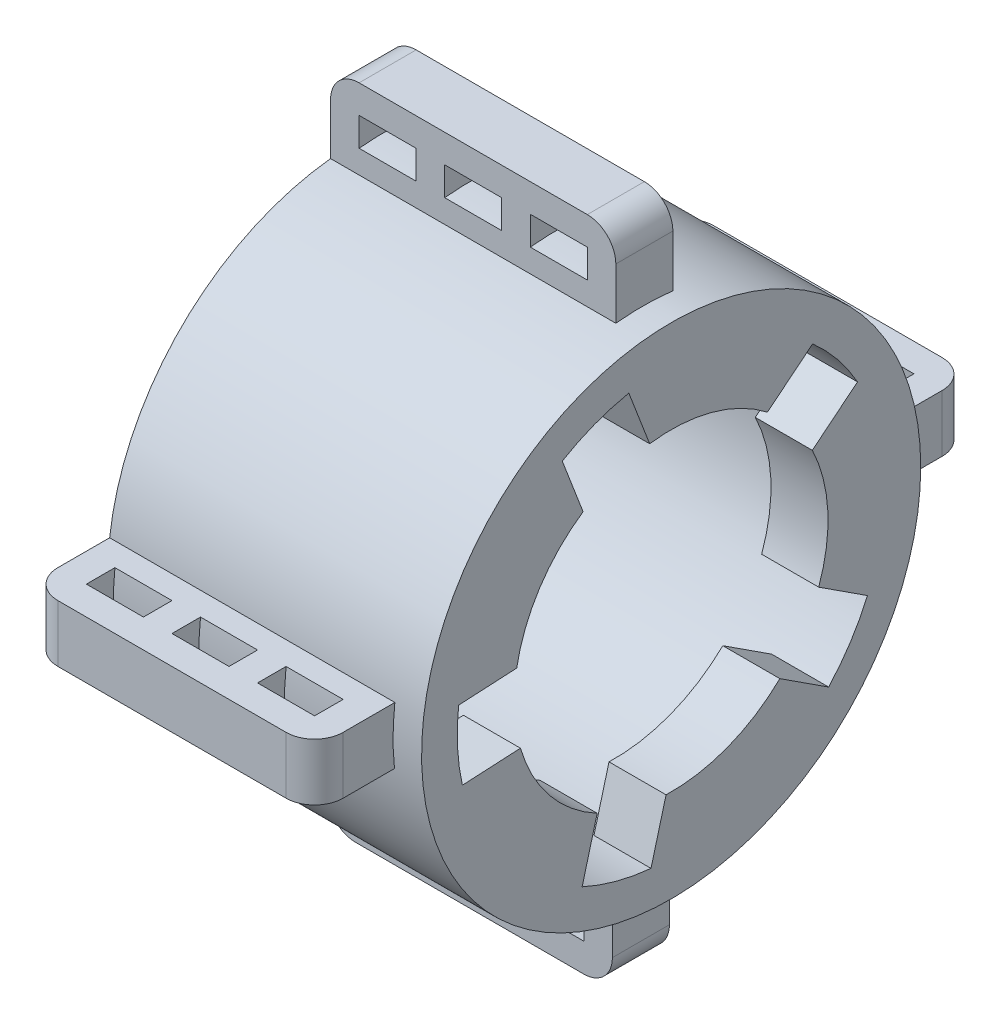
from build123d import *

# Parameters (mm, degrees)
SKETCH_2_R           = 15
EXTRUDE_1_DEPTH      = 20
SKETCH_3_W           = 4
SKETCH_3_H           = 2
FILLET_1_R           = 2
EXTRUDE_2_DEPTH      = 2
EXTRUDE_2_DEPTH_BACK = 2
SKETCH_4_R           = 17.5
CUT_EXTRUDE_1_REACH  = 41.268
SKETCH_5_R           = 4


with BuildPart() as part:
    # Sketch 2 → Extrude 1 (new body)
    with BuildSketch(Plane(origin=(0, 0, 0), x_dir=(0, 0, -1), z_dir=(1, 0, 0))):
        with BuildLine():
            Line((-1.878787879, 23), (2.121212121, 23))
            Line((2.121212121, 23), (2.121212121, 17.370965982))
            ThreePointArc((2.121212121, 17.370965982), (12.46034313, 12.287792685), (17.398855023, 1.878787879))
            Line((17.398855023, 1.878787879), (23, 1.878787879))
            Line((23, 1.878787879), (23, -2.121212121))
            Line((23, -2.121212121), (17.370965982, -2.121212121))
            ThreePointArc((17.370965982, -2.121212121), (12.287792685, -12.46034313), (1.878787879, -17.398855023))
            Line((1.878787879, -17.398855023), (1.878787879, -23))
            Line((1.878787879, -23), (-2.121212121, -23))
            Line((-2.121212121, -23), (-2.121212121, -17.370965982))
            ThreePointArc((-2.121212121, -17.370965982), (-12.46034313, -12.287792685), (-17.398855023, -1.878787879))
            Line((-17.398855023, -1.878787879), (-23, -1.878787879))
            Line((-23, -1.878787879), (-23, 2.121212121))
            Line((-23, 2.121212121), (-17.370965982, 2.121212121))
            ThreePointArc((-17.370965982, 2.121212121), (-12.287792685, 12.46034313), (-1.878787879, 17.398855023))
            Line((-1.878787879, 17.398855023), (-1.878787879, 23))
        make_face()
        Circle(SKETCH_2_R, mode=Mode.SUBTRACT)
    extrude(amount=EXTRUDE_1_DEPTH)

    # Sweep 1: sweep along a curve in space
    with BuildLine() as sweep_1_path:
        ThreePointArc((20, 0, -15), (20, 10.606601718, -10.606601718), (20, 15, 0))
        ThreePointArc((20, 15, 0), (20, 10.606601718, 10.606601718), (20, 0, 15))
        ThreePointArc((20, 0, 15), (20, -10.606601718, 10.606601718), (20, -15, 0))
        ThreePointArc((20, -15, 0), (20, -10.606601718, -10.606601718), (20, 0, -15))
    # Sketch 3 → Sweep 1 (sweep, cut)
    with BuildSketch(Plane.XY.offset(2.121212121)):
        with Locations((16, -20)):
            Rectangle(SKETCH_3_W, SKETCH_3_H)
        with Locations((10, -20)):
            Rectangle(SKETCH_3_W, SKETCH_3_H)
        with Locations((4, -20)):
            Rectangle(SKETCH_3_W, SKETCH_3_H)
    sweep(path=sweep_1_path.line, mode=Mode.SUBTRACT)

    # Fillet 1
    fillet_1_edges = [part.edges().sort_by_distance(p)[0] for p in [
        (20, 0.121212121, 23),
        (0, 23, -0.121212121),
        (0, -0.121212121, -23),
        (0, -23, 0.121212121),
        (0, 0.121212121, 23),
        (20, -23, 0.121212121),
        (20, -0.121212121, -23),
        (20, 23, -0.121212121),
    ]]
    fillet(fillet_1_edges, radius=FILLET_1_R)

    # Sketch 4 → Extrude 2 (add, two sides: drawn at the far end of the back side and taken through both)
    with BuildSketch(Plane(origin=(20, 0, 0), x_dir=(0, 0, -1), z_dir=(1, 0, 0)).offset(-EXTRUDE_2_DEPTH_BACK)):
        with Locations(Location((0, 0, 0), (0, 0, 186.16311346))):
            Circle(SKETCH_4_R)
    extrude(amount=EXTRUDE_2_DEPTH + EXTRUDE_2_DEPTH_BACK)

    # Sketch 5 → Cut-Extrude 1 (cut, up to next)
    with BuildSketch(Plane(origin=(22, 0, 0), x_dir=(0, 0, -1), z_dir=(1, 0, 0)), mode=Mode.PRIVATE) as cut_extrude_1_sk1:
        Circle(SKETCH_5_R)
    cut_extrude_1_tool1 = extrude(cut_extrude_1_sk1.sketch, amount=-CUT_EXTRUDE_1_REACH, mode=Mode.PRIVATE) & part.part
    # Sketch 5 → Cut-Extrude 1 (cut, up to next)
    with BuildSketch(Plane(origin=(22, 0, 0), x_dir=(0, 0, -1), z_dir=(1, 0, 0)), mode=Mode.PRIVATE) as cut_extrude_1_sk2:
        with BuildLine():
            ThreePointArc((-14.900889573, 1.721479), (-14.979388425, -0.786080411), (-14.638862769, -3.271650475))
            Line((-14.638862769, -3.271650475), (-10.566409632, -3.057938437))
            ThreePointArc((-10.566409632, -3.057938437), (-10.984884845, -0.576458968), (-10.828436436, 1.935191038))
            Line((-10.828436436, 1.935191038), (-14.900889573, 1.721479))
        make_face()
    cut_extrude_1_tool2 = extrude(cut_extrude_1_sk2.sketch, amount=-CUT_EXTRUDE_1_REACH, mode=Mode.PRIVATE) & part.part
    # Sketch 5 → Cut-Extrude 1 (cut, up to next)
    with BuildSketch(Plane(origin=(22, 0, 0), x_dir=(0, 0, -1), z_dir=(1, 0, 0)), mode=Mode.PRIVATE) as cut_extrude_1_sk3:
        with BuildLine():
            Line((-10.566409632, -3.057938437), (-3.305213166, -2.676889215))
            Line((-3.305213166, -2.676889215), (-3.222812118, -2.369278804))
            ThreePointArc((-3.222812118, -2.369278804), (-3.99450358, -0.209621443), (-3.453094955, 2.018944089))
            Line((-3.453094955, 2.018944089), (-3.56723997, 2.31624026))
            Line((-3.56723997, 2.31624026), (-10.828436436, 1.935191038))
            ThreePointArc((-10.828436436, 1.935191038), (-10.984884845, -0.576458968), (-10.566409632, -3.057938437))
        make_face()
    cut_extrude_1_tool3 = extrude(cut_extrude_1_sk3.sketch, amount=-CUT_EXTRUDE_1_REACH, mode=Mode.PRIVATE) & part.part
    # Sketch 5 → Cut-Extrude 1 (cut, up to next)
    with BuildSketch(Plane(origin=(22, 0, 0), x_dir=(0, 0, -1), z_dir=(1, 0, 0)), mode=Mode.PRIVATE) as cut_extrude_1_sk4:
        with BuildLine():
            Line((-0.356927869, -10.994207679), (1.524505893, -3.970648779))
            Line((1.524505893, -3.970648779), (1.257414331, -3.797223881))
            ThreePointArc((1.257414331, -3.797223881), (-1.035007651, -3.863775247), (-2.987194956, -2.660200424))
            Line((-2.987194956, -2.660200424), (-3.305213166, -2.676889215))
            Line((-3.305213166, -2.676889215), (-5.186646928, -9.700448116))
            ThreePointArc((-5.186646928, -9.700448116), (-2.84627104, -10.62538193), (-0.356927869, -10.994207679))
        make_face()
    cut_extrude_1_tool4 = extrude(cut_extrude_1_sk4.sketch, amount=-CUT_EXTRUDE_1_REACH, mode=Mode.PRIVATE) & part.part
    # Sketch 5 → Cut-Extrude 1 (cut, up to next)
    with BuildSketch(Plane(origin=(22, 0, 0), x_dir=(0, 0, -1), z_dir=(1, 0, 0)), mode=Mode.PRIVATE) as cut_extrude_1_sk5:
        with BuildLine():
            ThreePointArc((-6.241851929, -13.63962186), (-3.881278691, -14.489157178), (-1.41213287, -14.933381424))
            Line((-1.41213287, -14.933381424), (-0.356927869, -10.994207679))
            ThreePointArc((-0.356927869, -10.994207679), (-2.84627104, -10.62538193), (-5.186646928, -9.700448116))
            Line((-5.186646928, -9.700448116), (-6.241851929, -13.63962186))
        make_face()
    cut_extrude_1_tool5 = extrude(cut_extrude_1_sk5.sketch, amount=-CUT_EXTRUDE_1_REACH, mode=Mode.PRIVATE) & part.part
    # Sketch 5 → Cut-Extrude 1 (cut, up to next)
    with BuildSketch(Plane(origin=(22, 0, 0), x_dir=(0, 0, -1), z_dir=(1, 0, 0)), mode=Mode.PRIVATE) as cut_extrude_1_sk6:
        with BuildLine():
            ThreePointArc((7.622912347, -7.93039768), (8.480013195, -7.006381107), (9.225792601, -5.990388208))
            Line((9.225792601, -5.990388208), (3.354833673, -2.178322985))
            ThreePointArc((3.354833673, -2.178322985), (2.589558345, -3.048637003), (1.606906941, -3.663038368))
            Line((1.606906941, -3.663038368), (1.524505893, -3.970648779))
            Line((1.524505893, -3.970648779), (7.622912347, -7.93039768))
        make_face()
    cut_extrude_1_tool6 = extrude(cut_extrude_1_sk6.sketch, amount=-CUT_EXTRUDE_1_REACH, mode=Mode.PRIVATE) & part.part
    # Sketch 5 → Cut-Extrude 1 (cut, up to next)
    with BuildSketch(Plane(origin=(22, 0, 0), x_dir=(0, 0, -1), z_dir=(1, 0, 0)), mode=Mode.PRIVATE) as cut_extrude_1_sk7:
        with BuildLine():
            Line((3.354833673, -2.178322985), (9.225792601, -5.990388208))
            ThreePointArc((9.225792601, -5.990388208), (9.850460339, -4.89575644), (10.345816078, -3.736855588))
            Line((10.345816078, -3.736855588), (4.247409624, 0.222893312))
            Line((4.247409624, 0.222893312), (3.999936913, 0.022465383))
            ThreePointArc((3.999936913, 0.022465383), (3.999984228, 0.011232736), (4, 0))
            ThreePointArc((4, 0), (3.835318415, -1.135928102), (3.354833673, -2.178322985))
        make_face()
    cut_extrude_1_tool7 = extrude(cut_extrude_1_sk7.sketch, amount=-CUT_EXTRUDE_1_REACH, mode=Mode.PRIVATE) & part.part
    # Sketch 5 → Cut-Extrude 1 (cut, up to next)
    with BuildSketch(Plane(origin=(22, 0, 0), x_dir=(0, 0, -1), z_dir=(1, 0, 0)), mode=Mode.PRIVATE) as cut_extrude_1_sk8:
        with BuildLine():
            Line((9.225792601, -5.990388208), (12.580626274, -8.168711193))
            ThreePointArc((12.580626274, -8.168711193), (13.219677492, -7.088027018), (13.766116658, -5.957686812))
            Line((13.766116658, -5.957686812), (10.345816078, -3.736855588))
            ThreePointArc((10.345816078, -3.736855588), (9.850460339, -4.89575644), (9.225792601, -5.990388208))
        make_face()
    cut_extrude_1_tool8 = extrude(cut_extrude_1_sk8.sketch, amount=-CUT_EXTRUDE_1_REACH, mode=Mode.PRIVATE) & part.part
    # Sketch 5 → Cut-Extrude 1 (cut, up to next)
    with BuildSketch(Plane(origin=(22, 0, 0), x_dir=(0, 0, -1), z_dir=(1, 0, 0)), mode=Mode.PRIVATE) as cut_extrude_1_sk9:
        with BuildLine():
            ThreePointArc((11.043212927, -10.151228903), (11.853439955, -9.192168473), (12.580626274, -8.168711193))
            Line((12.580626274, -8.168711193), (9.225792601, -5.990388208))
            ThreePointArc((9.225792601, -5.990388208), (8.480013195, -7.006381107), (7.622912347, -7.93039768))
            Line((7.622912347, -7.93039768), (11.043212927, -10.151228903))
        make_face()
    cut_extrude_1_tool9 = extrude(cut_extrude_1_sk9.sketch, amount=-CUT_EXTRUDE_1_REACH, mode=Mode.PRIVATE) & part.part
    # Sketch 5 → Cut-Extrude 1 (cut, up to next)
    with BuildSketch(Plane(origin=(22, 0, 0), x_dir=(0, 0, -1), z_dir=(1, 0, 0)), mode=Mode.PRIVATE) as cut_extrude_1_sk10:
        with BuildLine():
            Line((9.897865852, 4.799192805), (13.066932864, 7.365817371))
            ThreePointArc((13.066932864, 7.365817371), (11.656533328, 9.440616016), (9.920060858, 11.25132848))
            Line((9.920060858, 11.25132848), (6.750993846, 8.684703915))
            ThreePointArc((6.750993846, 8.684703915), (8.548124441, 6.923118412), (9.897865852, 4.799192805))
        make_face()
    cut_extrude_1_tool10 = extrude(cut_extrude_1_sk10.sketch, amount=-CUT_EXTRUDE_1_REACH, mode=Mode.PRIVATE) & part.part
    # Sketch 5 → Cut-Extrude 1 (cut, up to next)
    with BuildSketch(Plane(origin=(22, 0, 0), x_dir=(0, 0, -1), z_dir=(1, 0, 0)), mode=Mode.PRIVATE) as cut_extrude_1_sk11:
        with BuildLine():
            Line((3.980318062, 0.396318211), (4.247409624, 0.222893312))
            Line((4.247409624, 0.222893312), (9.897865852, 4.799192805))
            ThreePointArc((9.897865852, 4.799192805), (8.548124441, 6.923118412), (6.750993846, 8.684703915))
            Line((6.750993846, 8.684703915), (1.100537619, 4.108404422))
            Line((1.100537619, 4.108404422), (1.214682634, 3.811108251))
            ThreePointArc((1.214682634, 3.811108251), (3.108408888, 2.517497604), (3.980318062, 0.396318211))
        make_face()
    cut_extrude_1_tool11 = extrude(cut_extrude_1_sk11.sketch, amount=-CUT_EXTRUDE_1_REACH, mode=Mode.PRIVATE) & part.part
    # Sketch 5 → Cut-Extrude 1 (cut, up to next)
    with BuildSketch(Plane(origin=(22, 0, 0), x_dir=(0, 0, -1), z_dir=(1, 0, 0)), mode=Mode.PRIVATE) as cut_extrude_1_sk12:
        with BuildLine():
            Line((-1.505694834, 10.896461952), (-2.967404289, 14.703554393))
            ThreePointArc((-2.967404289, 14.703554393), (-5.376492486, 14.003332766), (-7.635181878, 12.911390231))
            Line((-7.635181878, 12.911390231), (-6.173472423, 9.10429779))
            ThreePointArc((-6.173472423, 9.10429779), (-3.942761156, 10.269110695), (-1.505694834, 10.896461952))
        make_face()
    cut_extrude_1_tool12 = extrude(cut_extrude_1_sk12.sketch, amount=-CUT_EXTRUDE_1_REACH, mode=Mode.PRIVATE) & part.part
    # Sketch 5 → Cut-Extrude 1 (cut, up to next)
    with BuildSketch(Plane(origin=(22, 0, 0), x_dir=(0, 0, -1), z_dir=(1, 0, 0)), mode=Mode.PRIVATE) as cut_extrude_1_sk13:
        with BuildLine():
            Line((0.853064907, 3.907976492), (1.100537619, 4.108404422))
            Line((1.100537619, 4.108404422), (-1.505694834, 10.896461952))
            ThreePointArc((-1.505694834, 10.896461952), (-3.942761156, 10.269110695), (-6.173472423, 9.10429779))
            Line((-6.173472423, 9.10429779), (-3.56723997, 2.31624026))
            Line((-3.56723997, 2.31624026), (-3.24922176, 2.332929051))
            ThreePointArc((-3.24922176, 2.332929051), (-1.43373133, 3.734222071), (0.853064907, 3.907976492))
        make_face()
    cut_extrude_1_tool13 = extrude(cut_extrude_1_sk13.sketch, amount=-CUT_EXTRUDE_1_REACH, mode=Mode.PRIVATE) & part.part
    # Sketch 5 → Cut-Extrude 1 (cut, up to next)
    with BuildSketch(Plane(origin=(22, 0, 0), x_dir=(0, 0, -1), z_dir=(1, 0, 0)), mode=Mode.PRIVATE) as cut_extrude_1_sk14:
        with BuildLine():
            Line((1.100537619, 4.108404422), (6.750993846, 8.684703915))
            ThreePointArc((6.750993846, 8.684703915), (2.84627104, 10.62538193), (-1.505694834, 10.896461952))
            Line((-1.505694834, 10.896461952), (1.100537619, 4.108404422))
        make_face()
    cut_extrude_1_tool14 = extrude(cut_extrude_1_sk14.sketch, amount=-CUT_EXTRUDE_1_REACH, mode=Mode.PRIVATE) & part.part
    # Sketch 5 → Cut-Extrude 1 (cut, up to next)
    with BuildSketch(Plane(origin=(22, 0, 0), x_dir=(0, 0, -1), z_dir=(1, 0, 0)), mode=Mode.PRIVATE) as cut_extrude_1_sk15:
        with BuildLine():
            Line((4.247409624, 0.222893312), (10.345816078, -3.736855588))
            ThreePointArc((10.345816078, -3.736855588), (10.835219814, -1.896842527), (11, 0))
            ThreePointArc((11, 0), (10.720926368, 2.462059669), (9.897865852, 4.799192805))
            Line((9.897865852, 4.799192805), (4.247409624, 0.222893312))
        make_face()
    cut_extrude_1_tool15 = extrude(cut_extrude_1_sk15.sketch, amount=-CUT_EXTRUDE_1_REACH, mode=Mode.PRIVATE) & part.part
    # Sketch 5 → Cut-Extrude 1 (cut, up to next)
    with BuildSketch(Plane(origin=(22, 0, 0), x_dir=(0, 0, -1), z_dir=(1, 0, 0)), mode=Mode.PRIVATE) as cut_extrude_1_sk16:
        with BuildLine():
            ThreePointArc((-0.356927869, -10.994207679), (3.942761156, -10.269110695), (7.622912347, -7.93039768))
            Line((7.622912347, -7.93039768), (1.524505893, -3.970648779))
            Line((1.524505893, -3.970648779), (-0.356927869, -10.994207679))
        make_face()
    cut_extrude_1_tool16 = extrude(cut_extrude_1_sk16.sketch, amount=-CUT_EXTRUDE_1_REACH, mode=Mode.PRIVATE) & part.part
    # Sketch 5 → Cut-Extrude 1 (cut, up to next)
    with BuildSketch(Plane(origin=(22, 0, 0), x_dir=(0, 0, -1), z_dir=(1, 0, 0)), mode=Mode.PRIVATE) as cut_extrude_1_sk17:
        with BuildLine():
            ThreePointArc((-10.566409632, -3.057938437), (-8.548124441, -6.923118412), (-5.186646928, -9.700448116))
            Line((-5.186646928, -9.700448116), (-3.305213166, -2.676889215))
            Line((-3.305213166, -2.676889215), (-10.566409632, -3.057938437))
        make_face()
    cut_extrude_1_tool17 = extrude(cut_extrude_1_sk17.sketch, amount=-CUT_EXTRUDE_1_REACH, mode=Mode.PRIVATE) & part.part
    # Sketch 5 → Cut-Extrude 1 (cut, up to next)
    with BuildSketch(Plane(origin=(22, 0, 0), x_dir=(0, 0, -1), z_dir=(1, 0, 0)), mode=Mode.PRIVATE) as cut_extrude_1_sk18:
        with BuildLine():
            ThreePointArc((-6.173472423, 9.10429779), (-9.225792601, 5.990388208), (-10.828436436, 1.935191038))
            Line((-10.828436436, 1.935191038), (-3.56723997, 2.31624026))
            Line((-3.56723997, 2.31624026), (-6.173472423, 9.10429779))
        make_face()
    cut_extrude_1_tool18 = extrude(cut_extrude_1_sk18.sketch, amount=-CUT_EXTRUDE_1_REACH, mode=Mode.PRIVATE) & part.part
    # Sketch 5 → Cut-Extrude 1 (cut, up to next)
    with BuildSketch(Plane(origin=(22, 0, 0), x_dir=(0, 0, -1), z_dir=(1, 0, 0)), mode=Mode.PRIVATE) as cut_extrude_1_sk19:
        with BuildLine():
            Line((3.999936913, 0.022465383), (4.247409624, 0.222893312))
            Line((4.247409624, 0.222893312), (3.980318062, 0.396318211))
            ThreePointArc((3.980318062, 0.396318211), (3.99450358, 0.209621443), (3.999936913, 0.022465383))
        make_face()
    cut_extrude_1_tool19 = extrude(cut_extrude_1_sk19.sketch, amount=-CUT_EXTRUDE_1_REACH, mode=Mode.PRIVATE) & part.part
    # Sketch 5 → Cut-Extrude 1 (cut, up to next)
    with BuildSketch(Plane(origin=(22, 0, 0), x_dir=(0, 0, -1), z_dir=(1, 0, 0)), mode=Mode.PRIVATE) as cut_extrude_1_sk20:
        with BuildLine():
            Line((1.524505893, -3.970648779), (1.606906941, -3.663038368))
            ThreePointArc((1.606906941, -3.663038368), (1.43373133, -3.734222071), (1.257414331, -3.797223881))
            Line((1.257414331, -3.797223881), (1.524505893, -3.970648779))
        make_face()
    cut_extrude_1_tool20 = extrude(cut_extrude_1_sk20.sketch, amount=-CUT_EXTRUDE_1_REACH, mode=Mode.PRIVATE) & part.part
    # Sketch 5 → Cut-Extrude 1 (cut, up to next)
    with BuildSketch(Plane(origin=(22, 0, 0), x_dir=(0, 0, -1), z_dir=(1, 0, 0)), mode=Mode.PRIVATE) as cut_extrude_1_sk21:
        with BuildLine():
            Line((-3.305213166, -2.676889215), (-2.987194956, -2.660200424))
            ThreePointArc((-2.987194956, -2.660200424), (-3.108408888, -2.517497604), (-3.222812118, -2.369278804))
            Line((-3.222812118, -2.369278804), (-3.305213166, -2.676889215))
        make_face()
    cut_extrude_1_tool21 = extrude(cut_extrude_1_sk21.sketch, amount=-CUT_EXTRUDE_1_REACH, mode=Mode.PRIVATE) & part.part
    # Sketch 5 → Cut-Extrude 1 (cut, up to next)
    with BuildSketch(Plane(origin=(22, 0, 0), x_dir=(0, 0, -1), z_dir=(1, 0, 0)), mode=Mode.PRIVATE) as cut_extrude_1_sk22:
        with BuildLine():
            Line((-3.56723997, 2.31624026), (-3.453094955, 2.018944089))
            ThreePointArc((-3.453094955, 2.018944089), (-3.354833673, 2.178322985), (-3.24922176, 2.332929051))
            Line((-3.24922176, 2.332929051), (-3.56723997, 2.31624026))
        make_face()
    cut_extrude_1_tool22 = extrude(cut_extrude_1_sk22.sketch, amount=-CUT_EXTRUDE_1_REACH, mode=Mode.PRIVATE) & part.part
    # Sketch 5 → Cut-Extrude 1 (cut, up to next)
    with BuildSketch(Plane(origin=(22, 0, 0), x_dir=(0, 0, -1), z_dir=(1, 0, 0)), mode=Mode.PRIVATE) as cut_extrude_1_sk23:
        with BuildLine():
            ThreePointArc((0.853064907, 3.907976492), (1.035007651, 3.863775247), (1.214682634, 3.811108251))
            Line((1.214682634, 3.811108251), (1.100537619, 4.108404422))
            Line((1.100537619, 4.108404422), (0.853064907, 3.907976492))
        make_face()
    cut_extrude_1_tool23 = extrude(cut_extrude_1_sk23.sketch, amount=-CUT_EXTRUDE_1_REACH, mode=Mode.PRIVATE) & part.part
    add(cut_extrude_1_tool1.solids().sort_by_distance((22, 0, 0))[0], mode=Mode.SUBTRACT)
    add(cut_extrude_1_tool2.solids().sort_by_distance((22, -0.676919, 12.899234))[0], mode=Mode.SUBTRACT)
    add(cut_extrude_1_tool3.solids().sort_by_distance((22, -0.383585, 7.309524))[0], mode=Mode.SUBTRACT)
    add(cut_extrude_1_tool4.solids().sort_by_distance((22, -7.070304, 1.893956))[0], mode=Mode.SUBTRACT)
    add(cut_extrude_1_tool5.solids().sort_by_distance((22, -12.47708, 3.342294))[0], mode=Mode.SUBTRACT)
    add(cut_extrude_1_tool6.solids().sort_by_distance((22, -5.045787, -5.450932))[0], mode=Mode.SUBTRACT)
    add(cut_extrude_1_tool7.solids().sort_by_distance((22, -2.926419, -6.827057))[0], mode=Mode.SUBTRACT)
    add(cut_extrude_1_tool8.solids().sort_by_distance((22, -5.982587, -11.516495))[0], mode=Mode.SUBTRACT)
    add(cut_extrude_1_tool9.solids().sort_by_distance((22, -8.086093, -10.15067))[0], mode=Mode.SUBTRACT)
    add(cut_extrude_1_tool10.solids().sort_by_distance((22, 8.129618, -10.037816))[0], mode=Mode.SUBTRACT)
    add(cut_extrude_1_tool11.solids().sort_by_distance((22, 4.606757, -5.688063))[0], mode=Mode.SUBTRACT)
    add(cut_extrude_1_tool12.solids().sort_by_distance((22, 12.058721, 4.629871))[0], mode=Mode.SUBTRACT)
    add(cut_extrude_1_tool13.solids().sort_by_distance((22, 6.833236, 2.623578))[0], mode=Mode.SUBTRACT)
    add(cut_extrude_1_tool14.solids().sort_by_distance((22, 8.264136, -2.213753))[0], mode=Mode.SUBTRACT)
    add(cut_extrude_1_tool15.solids().sort_by_distance((22, 0.448354, -8.543747))[0], mode=Mode.SUBTRACT)
    add(cut_extrude_1_tool16.solids().sort_by_distance((22, -7.987037, -3.066573))[0], mode=Mode.SUBTRACT)
    add(cut_extrude_1_tool17.solids().sort_by_distance((22, -5.384615, 6.648501))[0], mode=Mode.SUBTRACT)
    add(cut_extrude_1_tool18.solids().sort_by_distance((22, 4.659162, 7.175573))[0], mode=Mode.SUBTRACT)
    add(cut_extrude_1_tool19.solids().sort_by_distance((22, 0.213995, -4.077838))[0], mode=Mode.SUBTRACT)
    add(cut_extrude_1_tool20.solids().sort_by_distance((22, -3.812126, -1.463642))[0], mode=Mode.SUBTRACT)
    add(cut_extrude_1_tool21.solids().sort_by_distance((22, -2.570018, 3.173257))[0], mode=Mode.SUBTRACT)
    add(cut_extrude_1_tool22.solids().sort_by_distance((22, 2.223768, 3.424823))[0], mode=Mode.SUBTRACT)
    add(cut_extrude_1_tool23.solids().sort_by_distance((22, 3.944382, -1.0566))[0], mode=Mode.SUBTRACT)


solid = part.part
